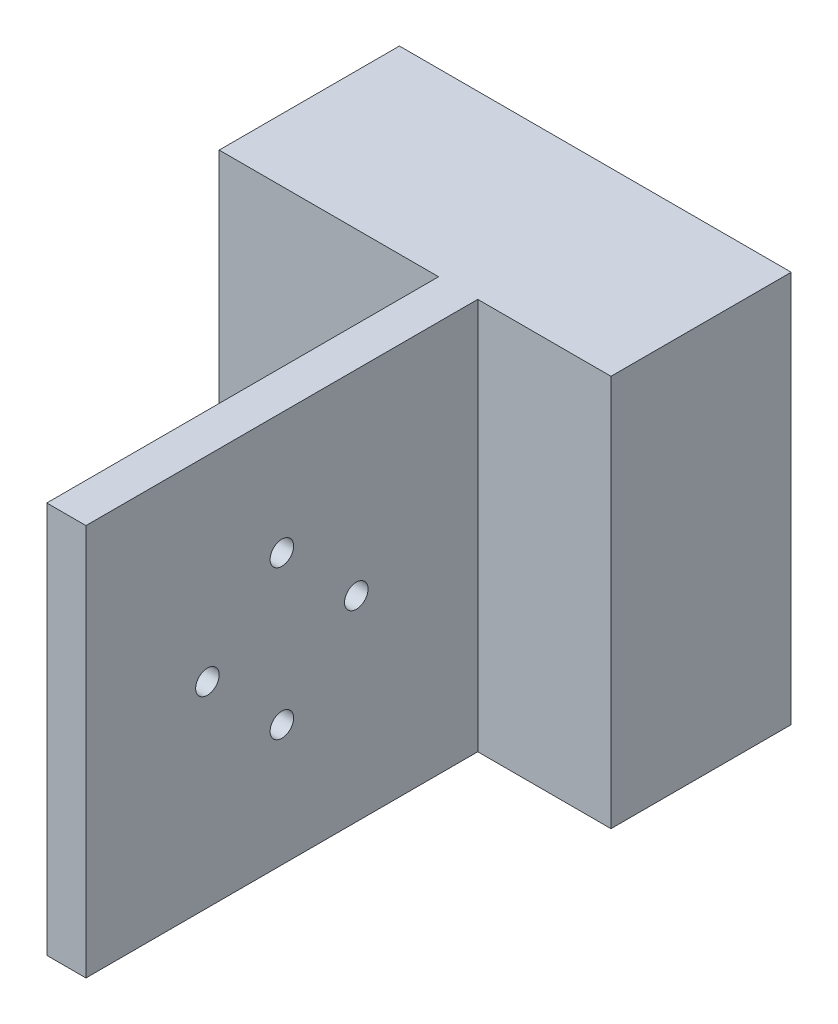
ISO-10303-21;
HEADER;
FILE_DESCRIPTION(('STEP AP214'),'2;1');
FILE_NAME('part.step','',(''),(''),'','','');
FILE_SCHEMA(('AUTOMOTIVE_DESIGN { 1 0 10303 214 1 1 1 1 }'));
ENDSEC;
DATA;
#1=APPLICATION_CONTEXT('core data for automotive mechanical design processes');
#2=APPLICATION_PROTOCOL_DEFINITION('international standard','automotive_design',2000,#1);
#3=PRODUCT_CONTEXT('',#1,'mechanical');
#4=PRODUCT('Part','Part','',(#3));
#5=PRODUCT_RELATED_PRODUCT_CATEGORY('part','',(#4));
#6=PRODUCT_DEFINITION_FORMATION('','',#4);
#7=PRODUCT_DEFINITION_CONTEXT('part definition',#1,'design');
#8=PRODUCT_DEFINITION('design','',#6,#7);
#9=PRODUCT_DEFINITION_SHAPE('','',#8);
#10=(LENGTH_UNIT() NAMED_UNIT(*) SI_UNIT(.MILLI.,.METRE.));
#11=(NAMED_UNIT(*) PLANE_ANGLE_UNIT() SI_UNIT($,.RADIAN.));
#12=(NAMED_UNIT(*) SI_UNIT($,.STERADIAN.) SOLID_ANGLE_UNIT());
#13=UNCERTAINTY_MEASURE_WITH_UNIT(LENGTH_MEASURE(1.E-05),#10,'distance_accuracy_value','');
#14=(GEOMETRIC_REPRESENTATION_CONTEXT(3) GLOBAL_UNCERTAINTY_ASSIGNED_CONTEXT((#13)) GLOBAL_UNIT_ASSIGNED_CONTEXT((#10,
#11,#12)) REPRESENTATION_CONTEXT('',''));
#15=CARTESIAN_POINT('',(0.,0.,0.));
#16=DIRECTION('',(0.,0.,1.));
#17=DIRECTION('',(1.,0.,0.));
#18=AXIS2_PLACEMENT_3D('',#15,#16,#17);
#19=CARTESIAN_POINT('',(5.,0.,0.));
#20=DIRECTION('',(1.,0.,0.));
#21=DIRECTION('',(0.,0.,-1.));
#22=AXIS2_PLACEMENT_3D('',#19,#20,#21);
#23=PLANE('',#22);
#24=CARTESIAN_POINT('',(5.,0.,9.50000000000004));
#25=DIRECTION('',(1.,0.,0.));
#26=DIRECTION('',(0.,0.,-1.));
#27=AXIS2_PLACEMENT_3D('',#24,#25,#26);
#28=CIRCLE('',#27,1.50000000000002);
#29=CARTESIAN_POINT('',(5.,0.,8.00000000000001));
#30=VERTEX_POINT('',#29);
#31=EDGE_CURVE('E158',#30,#30,#28,.T.);
#32=ORIENTED_EDGE('',*,*,#31,.F.);
#33=EDGE_LOOP('',(#32));
#34=FACE_BOUND('',#33,.T.);
#35=CARTESIAN_POINT('',(5.,0.,-9.5));
#36=DIRECTION('',(1.,0.,0.));
#37=DIRECTION('',(0.,0.,-1.));
#38=AXIS2_PLACEMENT_3D('',#35,#36,#37);
#39=CIRCLE('',#38,1.5);
#40=CARTESIAN_POINT('',(5.,0.,-11.));
#41=VERTEX_POINT('',#40);
#42=EDGE_CURVE('E120',#41,#41,#39,.T.);
#43=ORIENTED_EDGE('',*,*,#42,.F.);
#44=EDGE_LOOP('',(#43));
#45=FACE_BOUND('',#44,.T.);
#46=DIRECTION('',(0.,0.,-1.));
#47=VECTOR('',#46,1.);
#48=CARTESIAN_POINT('',(5.,-25.,-25.));
#49=LINE('',#48,#47);
#50=CARTESIAN_POINT('',(5.,-25.,25.));
#51=VERTEX_POINT('',#50);
#52=CARTESIAN_POINT('',(5.,-25.,-25.));
#53=VERTEX_POINT('',#52);
#54=EDGE_CURVE('E109',#51,#53,#49,.T.);
#55=ORIENTED_EDGE('',*,*,#54,.T.);
#56=DIRECTION('',(0.,1.,0.));
#57=VECTOR('',#56,1.);
#58=CARTESIAN_POINT('',(5.,25.,-25.));
#59=LINE('',#58,#57);
#60=CARTESIAN_POINT('',(5.,25.,-25.));
#61=VERTEX_POINT('',#60);
#62=EDGE_CURVE('E95',#53,#61,#59,.T.);
#63=ORIENTED_EDGE('',*,*,#62,.T.);
#64=DIRECTION('',(0.,0.,1.));
#65=VECTOR('',#64,1.);
#66=CARTESIAN_POINT('',(5.,25.,-25.));
#67=LINE('',#66,#65);
#68=CARTESIAN_POINT('',(5.,25.,25.));
#69=VERTEX_POINT('',#68);
#70=EDGE_CURVE('E107',#61,#69,#67,.T.);
#71=ORIENTED_EDGE('',*,*,#70,.T.);
#72=DIRECTION('',(0.,-1.,0.));
#73=VECTOR('',#72,1.);
#74=CARTESIAN_POINT('',(5.,25.,25.));
#75=LINE('',#74,#73);
#76=EDGE_CURVE('E60',#69,#51,#75,.T.);
#77=ORIENTED_EDGE('',*,*,#76,.T.);
#78=EDGE_LOOP('',(#55,#63,#71,#77));
#79=FACE_BOUND('',#78,.T.);
#80=CARTESIAN_POINT('',(5.,-9.5,0.));
#81=DIRECTION('',(1.,0.,0.));
#82=DIRECTION('',(0.,0.,-1.));
#83=AXIS2_PLACEMENT_3D('',#80,#81,#82);
#84=CIRCLE('',#83,1.5);
#85=CARTESIAN_POINT('',(5.,-9.5,-1.49999999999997));
#86=VERTEX_POINT('',#85);
#87=EDGE_CURVE('E164',#86,#86,#84,.T.);
#88=ORIENTED_EDGE('',*,*,#87,.F.);
#89=EDGE_LOOP('',(#88));
#90=FACE_BOUND('',#89,.T.);
#91=CARTESIAN_POINT('',(5.,9.5,0.));
#92=DIRECTION('',(1.,0.,0.));
#93=DIRECTION('',(0.,0.,-1.));
#94=AXIS2_PLACEMENT_3D('',#91,#92,#93);
#95=CIRCLE('',#94,1.5);
#96=CARTESIAN_POINT('',(5.,9.5,-1.50000000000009));
#97=VERTEX_POINT('',#96);
#98=EDGE_CURVE('E152',#97,#97,#95,.T.);
#99=ORIENTED_EDGE('',*,*,#98,.F.);
#100=EDGE_LOOP('',(#99));
#101=FACE_BOUND('',#100,.T.);
#102=ADVANCED_FACE('F43',(#34,#45,#79,#90,#101),#23,.T.);
#103=CARTESIAN_POINT('',(0.,0.,0.));
#104=DIRECTION('',(1.,0.,0.));
#105=DIRECTION('',(0.,0.,-1.));
#106=AXIS2_PLACEMENT_3D('',#103,#104,#105);
#107=PLANE('',#106);
#108=DIRECTION('',(0.,0.,-1.));
#109=VECTOR('',#108,1.);
#110=CARTESIAN_POINT('',(0.,-25.,-25.));
#111=LINE('',#110,#109);
#112=CARTESIAN_POINT('',(0.,-25.,25.));
#113=VERTEX_POINT('',#112);
#114=CARTESIAN_POINT('',(0.,-25.,-25.));
#115=VERTEX_POINT('',#114);
#116=EDGE_CURVE('E116',#113,#115,#111,.T.);
#117=ORIENTED_EDGE('',*,*,#116,.F.);
#118=DIRECTION('',(0.,-1.,0.));
#119=VECTOR('',#118,1.);
#120=CARTESIAN_POINT('',(0.,25.,25.));
#121=LINE('',#120,#119);
#122=CARTESIAN_POINT('',(0.,25.,25.));
#123=VERTEX_POINT('',#122);
#124=EDGE_CURVE('E123',#123,#113,#121,.T.);
#125=ORIENTED_EDGE('',*,*,#124,.F.);
#126=DIRECTION('',(0.,0.,1.));
#127=VECTOR('',#126,1.);
#128=CARTESIAN_POINT('',(0.,25.,-25.));
#129=LINE('',#128,#127);
#130=CARTESIAN_POINT('',(0.,25.,-25.));
#131=VERTEX_POINT('',#130);
#132=EDGE_CURVE('E72',#131,#123,#129,.T.);
#133=ORIENTED_EDGE('',*,*,#132,.F.);
#134=DIRECTION('',(0.,1.,0.));
#135=VECTOR('',#134,1.);
#136=CARTESIAN_POINT('',(0.,25.,-25.));
#137=LINE('',#136,#135);
#138=EDGE_CURVE('E119',#115,#131,#137,.T.);
#139=ORIENTED_EDGE('',*,*,#138,.F.);
#140=EDGE_LOOP('',(#117,#125,#133,#139));
#141=FACE_BOUND('',#140,.T.);
#142=CARTESIAN_POINT('',(0.,0.,-9.5));
#143=DIRECTION('',(1.,0.,0.));
#144=DIRECTION('',(0.,0.,-1.));
#145=AXIS2_PLACEMENT_3D('',#142,#143,#144);
#146=CIRCLE('',#145,1.5);
#147=CARTESIAN_POINT('',(0.,0.,-11.));
#148=VERTEX_POINT('',#147);
#149=EDGE_CURVE('E167',#148,#148,#146,.T.);
#150=ORIENTED_EDGE('',*,*,#149,.T.);
#151=EDGE_LOOP('',(#150));
#152=FACE_BOUND('',#151,.T.);
#153=CARTESIAN_POINT('',(0.,-9.5,0.));
#154=DIRECTION('',(1.,0.,0.));
#155=DIRECTION('',(0.,0.,-1.));
#156=AXIS2_PLACEMENT_3D('',#153,#154,#155);
#157=CIRCLE('',#156,1.5);
#158=CARTESIAN_POINT('',(0.,-9.5,-1.49999999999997));
#159=VERTEX_POINT('',#158);
#160=EDGE_CURVE('E161',#159,#159,#157,.T.);
#161=ORIENTED_EDGE('',*,*,#160,.T.);
#162=EDGE_LOOP('',(#161));
#163=FACE_BOUND('',#162,.T.);
#164=CARTESIAN_POINT('',(0.,0.,9.50000000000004));
#165=DIRECTION('',(1.,0.,0.));
#166=DIRECTION('',(0.,0.,-1.));
#167=AXIS2_PLACEMENT_3D('',#164,#165,#166);
#168=CIRCLE('',#167,1.50000000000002);
#169=CARTESIAN_POINT('',(0.,0.,8.00000000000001));
#170=VERTEX_POINT('',#169);
#171=EDGE_CURVE('E155',#170,#170,#168,.T.);
#172=ORIENTED_EDGE('',*,*,#171,.T.);
#173=EDGE_LOOP('',(#172));
#174=FACE_BOUND('',#173,.T.);
#175=CARTESIAN_POINT('',(0.,9.5,0.));
#176=DIRECTION('',(1.,0.,0.));
#177=DIRECTION('',(0.,0.,-1.));
#178=AXIS2_PLACEMENT_3D('',#175,#176,#177);
#179=CIRCLE('',#178,1.5);
#180=CARTESIAN_POINT('',(0.,9.5,-1.50000000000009));
#181=VERTEX_POINT('',#180);
#182=EDGE_CURVE('E151',#181,#181,#179,.T.);
#183=ORIENTED_EDGE('',*,*,#182,.T.);
#184=EDGE_LOOP('',(#183));
#185=FACE_BOUND('',#184,.T.);
#186=ADVANCED_FACE('F130',(#141,#152,#163,#174,#185),#107,.F.);
#187=CARTESIAN_POINT('',(5.,-25.,-25.));
#188=DIRECTION('',(0.,1.,0.));
#189=DIRECTION('',(0.,0.,1.));
#190=AXIS2_PLACEMENT_3D('',#187,#188,#189);
#191=PLANE('',#190);
#192=ORIENTED_EDGE('',*,*,#116,.T.);
#193=DIRECTION('',(-1.,0.,0.));
#194=VECTOR('',#193,1.);
#195=CARTESIAN_POINT('',(-28.,-25.,-25.));
#196=LINE('',#195,#194);
#197=CARTESIAN_POINT('',(-28.,-25.,-25.));
#198=VERTEX_POINT('',#197);
#199=EDGE_CURVE('E81',#115,#198,#196,.T.);
#200=ORIENTED_EDGE('',*,*,#199,.T.);
#201=DIRECTION('',(0.,0.,1.));
#202=VECTOR('',#201,1.);
#203=CARTESIAN_POINT('',(-28.,-25.,-30.));
#204=LINE('',#203,#202);
#205=CARTESIAN_POINT('',(-28.,-25.,-48.));
#206=VERTEX_POINT('',#205);
#207=EDGE_CURVE('E145',#206,#198,#204,.T.);
#208=ORIENTED_EDGE('',*,*,#207,.F.);
#209=DIRECTION('',(-1.,0.,0.));
#210=VECTOR('',#209,1.);
#211=CARTESIAN_POINT('',(22.,-25.,-48.));
#212=LINE('',#211,#210);
#213=CARTESIAN_POINT('',(22.,-25.,-48.));
#214=VERTEX_POINT('',#213);
#215=EDGE_CURVE('E356',#214,#206,#212,.T.);
#216=ORIENTED_EDGE('',*,*,#215,.F.);
#217=DIRECTION('',(0.,0.,1.));
#218=VECTOR('',#217,1.);
#219=CARTESIAN_POINT('',(22.,-25.,-30.));
#220=LINE('',#219,#218);
#221=CARTESIAN_POINT('',(22.,-25.,-25.));
#222=VERTEX_POINT('',#221);
#223=EDGE_CURVE('E148',#214,#222,#220,.T.);
#224=ORIENTED_EDGE('',*,*,#223,.T.);
#225=EDGE_CURVE('E362',#222,#53,#196,.T.);
#226=ORIENTED_EDGE('',*,*,#225,.T.);
#227=ORIENTED_EDGE('',*,*,#54,.F.);
#228=DIRECTION('',(-1.,0.,0.));
#229=VECTOR('',#228,1.);
#230=CARTESIAN_POINT('',(5.,-25.,25.));
#231=LINE('',#230,#229);
#232=EDGE_CURVE('E52',#51,#113,#231,.T.);
#233=ORIENTED_EDGE('',*,*,#232,.T.);
#234=EDGE_LOOP('',(#192,#200,#208,#216,#224,#226,#227,#233));
#235=FACE_BOUND('',#234,.T.);
#236=ADVANCED_FACE('F45',(#235),#191,.F.);
#237=CARTESIAN_POINT('',(5.,25.,-25.));
#238=DIRECTION('',(0.,-1.,0.));
#239=DIRECTION('',(0.,0.,-1.));
#240=AXIS2_PLACEMENT_3D('',#237,#238,#239);
#241=PLANE('',#240);
#242=ORIENTED_EDGE('',*,*,#132,.T.);
#243=DIRECTION('',(-1.,0.,0.));
#244=VECTOR('',#243,1.);
#245=CARTESIAN_POINT('',(5.,25.,25.));
#246=LINE('',#245,#244);
#247=EDGE_CURVE('E11',#69,#123,#246,.T.);
#248=ORIENTED_EDGE('',*,*,#247,.F.);
#249=ORIENTED_EDGE('',*,*,#70,.F.);
#250=DIRECTION('',(1.,0.,0.));
#251=VECTOR('',#250,1.);
#252=CARTESIAN_POINT('',(22.,25.,-25.));
#253=LINE('',#252,#251);
#254=CARTESIAN_POINT('',(22.,25.,-25.));
#255=VERTEX_POINT('',#254);
#256=EDGE_CURVE('E91',#61,#255,#253,.T.);
#257=ORIENTED_EDGE('',*,*,#256,.T.);
#258=DIRECTION('',(0.,0.,1.));
#259=VECTOR('',#258,1.);
#260=CARTESIAN_POINT('',(22.,25.,-30.));
#261=LINE('',#260,#259);
#262=CARTESIAN_POINT('',(22.,25.,-48.));
#263=VERTEX_POINT('',#262);
#264=EDGE_CURVE('E139',#263,#255,#261,.T.);
#265=ORIENTED_EDGE('',*,*,#264,.F.);
#266=DIRECTION('',(1.,0.,0.));
#267=VECTOR('',#266,1.);
#268=CARTESIAN_POINT('',(-28.,25.,-48.));
#269=LINE('',#268,#267);
#270=CARTESIAN_POINT('',(-28.,25.,-48.));
#271=VERTEX_POINT('',#270);
#272=EDGE_CURVE('E348',#271,#263,#269,.T.);
#273=ORIENTED_EDGE('',*,*,#272,.F.);
#274=DIRECTION('',(0.,0.,1.));
#275=VECTOR('',#274,1.);
#276=CARTESIAN_POINT('',(-28.,25.,-30.));
#277=LINE('',#276,#275);
#278=CARTESIAN_POINT('',(-28.,25.,-25.));
#279=VERTEX_POINT('',#278);
#280=EDGE_CURVE('E138',#271,#279,#277,.T.);
#281=ORIENTED_EDGE('',*,*,#280,.T.);
#282=EDGE_CURVE('E103',#279,#131,#253,.T.);
#283=ORIENTED_EDGE('',*,*,#282,.T.);
#284=EDGE_LOOP('',(#242,#248,#249,#257,#265,#273,#281,#283));
#285=FACE_BOUND('',#284,.T.);
#286=ADVANCED_FACE('F111',(#285),#241,.F.);
#287=CARTESIAN_POINT('',(5.,25.,25.));
#288=DIRECTION('',(0.,0.,-1.));
#289=DIRECTION('',(-1.,0.,0.));
#290=AXIS2_PLACEMENT_3D('',#287,#288,#289);
#291=PLANE('',#290);
#292=ORIENTED_EDGE('',*,*,#124,.T.);
#293=ORIENTED_EDGE('',*,*,#232,.F.);
#294=ORIENTED_EDGE('',*,*,#76,.F.);
#295=ORIENTED_EDGE('',*,*,#247,.T.);
#296=EDGE_LOOP('',(#292,#293,#294,#295));
#297=FACE_BOUND('',#296,.T.);
#298=ADVANCED_FACE('F179',(#297),#291,.F.);
#299=CARTESIAN_POINT('',(5.,0.,-9.5));
#300=DIRECTION('',(-1.,0.,0.));
#301=DIRECTION('',(0.,0.,1.));
#302=AXIS2_PLACEMENT_3D('',#299,#300,#301);
#303=CYLINDRICAL_SURFACE('',#302,1.5);
#304=ORIENTED_EDGE('',*,*,#42,.T.);
#305=EDGE_LOOP('',(#304));
#306=FACE_BOUND('',#305,.T.);
#307=ORIENTED_EDGE('',*,*,#149,.F.);
#308=EDGE_LOOP('',(#307));
#309=FACE_BOUND('',#308,.T.);
#310=ADVANCED_FACE('F176',(#306,#309),#303,.F.);
#311=CARTESIAN_POINT('',(5.,-9.5,0.));
#312=DIRECTION('',(-1.,0.,0.));
#313=DIRECTION('',(0.,0.,1.));
#314=AXIS2_PLACEMENT_3D('',#311,#312,#313);
#315=CYLINDRICAL_SURFACE('',#314,1.5);
#316=ORIENTED_EDGE('',*,*,#87,.T.);
#317=EDGE_LOOP('',(#316));
#318=FACE_BOUND('',#317,.T.);
#319=ORIENTED_EDGE('',*,*,#160,.F.);
#320=EDGE_LOOP('',(#319));
#321=FACE_BOUND('',#320,.T.);
#322=ADVANCED_FACE('F178',(#318,#321),#315,.F.);
#323=CARTESIAN_POINT('',(5.,0.,9.50000000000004));
#324=DIRECTION('',(-1.,0.,0.));
#325=DIRECTION('',(0.,0.,1.));
#326=AXIS2_PLACEMENT_3D('',#323,#324,#325);
#327=CYLINDRICAL_SURFACE('',#326,1.50000000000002);
#328=ORIENTED_EDGE('',*,*,#31,.T.);
#329=EDGE_LOOP('',(#328));
#330=FACE_BOUND('',#329,.T.);
#331=ORIENTED_EDGE('',*,*,#171,.F.);
#332=EDGE_LOOP('',(#331));
#333=FACE_BOUND('',#332,.T.);
#334=ADVANCED_FACE('F186',(#330,#333),#327,.F.);
#335=CARTESIAN_POINT('',(5.,9.5,0.));
#336=DIRECTION('',(-1.,0.,0.));
#337=DIRECTION('',(0.,0.,1.));
#338=AXIS2_PLACEMENT_3D('',#335,#336,#337);
#339=CYLINDRICAL_SURFACE('',#338,1.5);
#340=ORIENTED_EDGE('',*,*,#98,.T.);
#341=EDGE_LOOP('',(#340));
#342=FACE_BOUND('',#341,.T.);
#343=ORIENTED_EDGE('',*,*,#182,.F.);
#344=EDGE_LOOP('',(#343));
#345=FACE_BOUND('',#344,.T.);
#346=ADVANCED_FACE('F225',(#342,#345),#339,.F.);
#347=CARTESIAN_POINT('',(0.,0.,-25.));
#348=DIRECTION('',(0.,0.,1.));
#349=DIRECTION('',(1.,0.,0.));
#350=AXIS2_PLACEMENT_3D('',#347,#348,#349);
#351=PLANE('',#350);
#352=ORIENTED_EDGE('',*,*,#62,.F.);
#353=ORIENTED_EDGE('',*,*,#225,.F.);
#354=DIRECTION('',(0.,-1.,0.));
#355=VECTOR('',#354,1.);
#356=CARTESIAN_POINT('',(22.,-25.,-25.));
#357=LINE('',#356,#355);
#358=EDGE_CURVE('E99',#255,#222,#357,.T.);
#359=ORIENTED_EDGE('',*,*,#358,.F.);
#360=ORIENTED_EDGE('',*,*,#256,.F.);
#361=EDGE_LOOP('',(#352,#353,#359,#360));
#362=FACE_BOUND('',#361,.T.);
#363=ADVANCED_FACE('F93',(#362),#351,.T.);
#364=CARTESIAN_POINT('',(22.,-25.,-30.));
#365=DIRECTION('',(-1.,0.,0.));
#366=DIRECTION('',(0.,-1.,0.));
#367=AXIS2_PLACEMENT_3D('',#364,#365,#366);
#368=PLANE('',#367);
#369=ORIENTED_EDGE('',*,*,#358,.T.);
#370=ORIENTED_EDGE('',*,*,#223,.F.);
#371=DIRECTION('',(0.,-1.,0.));
#372=VECTOR('',#371,1.);
#373=CARTESIAN_POINT('',(22.,25.,-48.));
#374=LINE('',#373,#372);
#375=EDGE_CURVE('E353',#263,#214,#374,.T.);
#376=ORIENTED_EDGE('',*,*,#375,.F.);
#377=ORIENTED_EDGE('',*,*,#264,.T.);
#378=EDGE_LOOP('',(#369,#370,#376,#377));
#379=FACE_BOUND('',#378,.T.);
#380=ADVANCED_FACE('F224',(#379),#368,.F.);
#381=CARTESIAN_POINT('',(-28.,25.,-30.));
#382=DIRECTION('',(1.,0.,0.));
#383=DIRECTION('',(0.,1.,0.));
#384=AXIS2_PLACEMENT_3D('',#381,#382,#383);
#385=PLANE('',#384);
#386=DIRECTION('',(0.,1.,0.));
#387=VECTOR('',#386,1.);
#388=CARTESIAN_POINT('',(-28.,25.,-25.));
#389=LINE('',#388,#387);
#390=EDGE_CURVE('E104',#198,#279,#389,.T.);
#391=ORIENTED_EDGE('',*,*,#390,.T.);
#392=ORIENTED_EDGE('',*,*,#280,.F.);
#393=DIRECTION('',(0.,1.,0.));
#394=VECTOR('',#393,1.);
#395=CARTESIAN_POINT('',(-28.,-25.,-48.));
#396=LINE('',#395,#394);
#397=EDGE_CURVE('E359',#206,#271,#396,.T.);
#398=ORIENTED_EDGE('',*,*,#397,.F.);
#399=ORIENTED_EDGE('',*,*,#207,.T.);
#400=EDGE_LOOP('',(#391,#392,#398,#399));
#401=FACE_BOUND('',#400,.T.);
#402=ADVANCED_FACE('F216',(#401),#385,.F.);
#403=ORIENTED_EDGE('',*,*,#199,.F.);
#404=ORIENTED_EDGE('',*,*,#138,.T.);
#405=ORIENTED_EDGE('',*,*,#282,.F.);
#406=ORIENTED_EDGE('',*,*,#390,.F.);
#407=EDGE_LOOP('',(#403,#404,#405,#406));
#408=FACE_BOUND('',#407,.T.);
#409=ADVANCED_FACE('F133',(#408),#351,.T.);
#410=CARTESIAN_POINT('',(0.,0.,-48.));
#411=DIRECTION('',(0.,0.,-1.));
#412=DIRECTION('',(-1.,0.,0.));
#413=AXIS2_PLACEMENT_3D('',#410,#411,#412);
#414=PLANE('',#413);
#415=ORIENTED_EDGE('',*,*,#272,.T.);
#416=ORIENTED_EDGE('',*,*,#375,.T.);
#417=ORIENTED_EDGE('',*,*,#215,.T.);
#418=ORIENTED_EDGE('',*,*,#397,.T.);
#419=EDGE_LOOP('',(#415,#416,#417,#418));
#420=FACE_BOUND('',#419,.T.);
#421=CARTESIAN_POINT('',(-3.,0.,-48.));
#422=DIRECTION('',(0.,0.,-1.));
#423=DIRECTION('',(-1.,0.,0.));
#424=AXIS2_PLACEMENT_3D('',#421,#422,#423);
#425=CIRCLE('',#424,6.);
#426=CARTESIAN_POINT('',(-9.00000000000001,0.,-48.));
#427=VERTEX_POINT('',#426);
#428=EDGE_CURVE('E343',#427,#427,#425,.T.);
#429=ORIENTED_EDGE('',*,*,#428,.F.);
#430=EDGE_LOOP('',(#429));
#431=FACE_BOUND('',#430,.T.);
#432=ADVANCED_FACE('F215',(#420,#431),#414,.T.);
#433=CARTESIAN_POINT('',(-3.,0.,-48.));
#434=DIRECTION('',(0.,0.,1.));
#435=DIRECTION('',(1.,0.,0.));
#436=AXIS2_PLACEMENT_3D('',#433,#434,#435);
#437=CYLINDRICAL_SURFACE('',#436,6.);
#438=ORIENTED_EDGE('',*,*,#428,.T.);
#439=EDGE_LOOP('',(#438));
#440=FACE_BOUND('',#439,.T.);
#441=CARTESIAN_POINT('',(-3.,0.,-30.));
#442=DIRECTION('',(0.,0.,-1.));
#443=DIRECTION('',(-1.,0.,0.));
#444=AXIS2_PLACEMENT_3D('',#441,#442,#443);
#445=CIRCLE('',#444,6.);
#446=CARTESIAN_POINT('',(-9.00000000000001,0.,-30.));
#447=VERTEX_POINT('',#446);
#448=EDGE_CURVE('E346',#447,#447,#445,.T.);
#449=ORIENTED_EDGE('',*,*,#448,.F.);
#450=EDGE_LOOP('',(#449));
#451=FACE_BOUND('',#450,.T.);
#452=ADVANCED_FACE('F309',(#440,#451),#437,.F.);
#453=CARTESIAN_POINT('',(0.,0.,-30.));
#454=DIRECTION('',(0.,0.,1.));
#455=DIRECTION('',(1.,0.,0.));
#456=AXIS2_PLACEMENT_3D('',#453,#454,#455);
#457=PLANE('',#456);
#458=ORIENTED_EDGE('',*,*,#448,.T.);
#459=EDGE_LOOP('',(#458));
#460=FACE_BOUND('',#459,.T.);
#461=ADVANCED_FACE('F305',(#460),#457,.F.);
#462=CLOSED_SHELL('',(#102,#186,#236,#286,#298,#310,#322,#334,#346,#363,#380,#402,#409,#432,
#452,#461));
#463=MANIFOLD_SOLID_BREP('B2',#462);
#464=ADVANCED_BREP_SHAPE_REPRESENTATION('',(#18,#463),#14);
#465=SHAPE_DEFINITION_REPRESENTATION(#9,#464);
ENDSEC;
END-ISO-10303-21;
